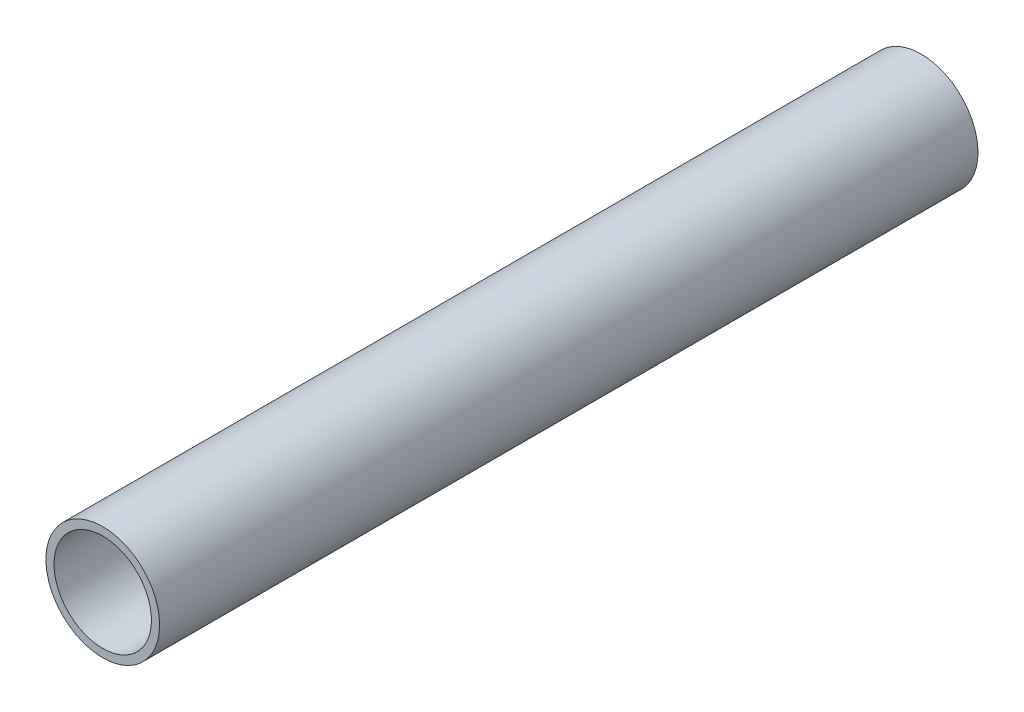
from build123d import *

# Parameters (mm, degrees)
ESQUISSE1_R        = 17.5
ESQUISSE1_R_2      = 15
EXTRU_MINCE1_DEPTH = 252


with BuildPart() as part:
    # Esquisse1 → Extru.-Mince1 (new body)
    with BuildSketch(Plane.XY):
        Circle(ESQUISSE1_R)
        Circle(ESQUISSE1_R_2, mode=Mode.SUBTRACT)
    extrude(amount=EXTRU_MINCE1_DEPTH)


solid = part.part
